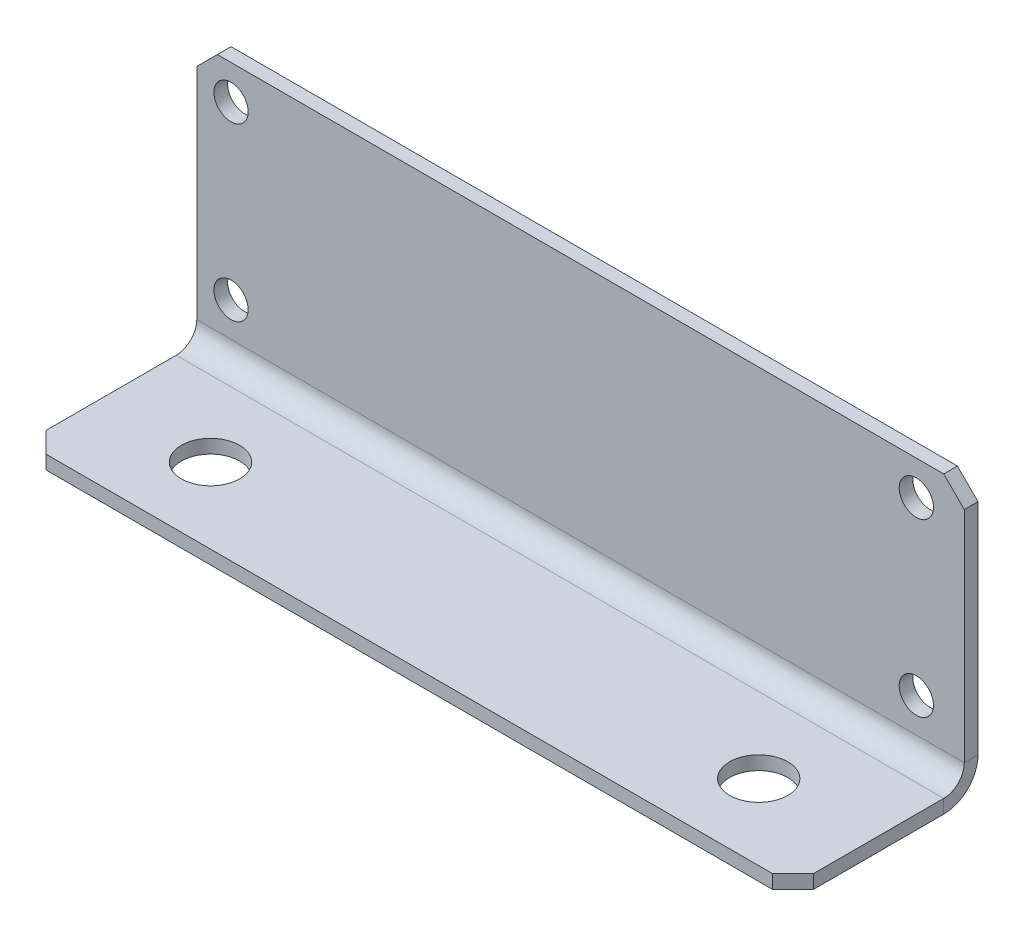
ISO-10303-21;
HEADER;
FILE_DESCRIPTION(('STEP AP214'),'2;1');
FILE_NAME('part.step','',(''),(''),'','','');
FILE_SCHEMA(('AUTOMOTIVE_DESIGN { 1 0 10303 214 1 1 1 1 }'));
ENDSEC;
DATA;
#1=APPLICATION_CONTEXT('core data for automotive mechanical design processes');
#2=APPLICATION_PROTOCOL_DEFINITION('international standard','automotive_design',2000,#1);
#3=PRODUCT_CONTEXT('',#1,'mechanical');
#4=PRODUCT('Part','Part','',(#3));
#5=PRODUCT_RELATED_PRODUCT_CATEGORY('part','',(#4));
#6=PRODUCT_DEFINITION_FORMATION('','',#4);
#7=PRODUCT_DEFINITION_CONTEXT('part definition',#1,'design');
#8=PRODUCT_DEFINITION('design','',#6,#7);
#9=PRODUCT_DEFINITION_SHAPE('','',#8);
#10=(LENGTH_UNIT() NAMED_UNIT(*) SI_UNIT(.MILLI.,.METRE.));
#11=(NAMED_UNIT(*) PLANE_ANGLE_UNIT() SI_UNIT($,.RADIAN.));
#12=(NAMED_UNIT(*) SI_UNIT($,.STERADIAN.) SOLID_ANGLE_UNIT());
#13=UNCERTAINTY_MEASURE_WITH_UNIT(LENGTH_MEASURE(1.E-05),#10,'distance_accuracy_value','');
#14=(GEOMETRIC_REPRESENTATION_CONTEXT(3) GLOBAL_UNCERTAINTY_ASSIGNED_CONTEXT((#13)) GLOBAL_UNIT_ASSIGNED_CONTEXT((#10,
#11,#12)) REPRESENTATION_CONTEXT('',''));
#15=CARTESIAN_POINT('',(0.,0.,0.));
#16=DIRECTION('',(0.,0.,1.));
#17=DIRECTION('',(1.,0.,0.));
#18=AXIS2_PLACEMENT_3D('',#15,#16,#17);
#19=CARTESIAN_POINT('',(56.,20.,2.));
#20=DIRECTION('',(-1.,0.,0.));
#21=DIRECTION('',(0.,-1.,0.));
#22=AXIS2_PLACEMENT_3D('',#19,#20,#21);
#23=PLANE('',#22);
#24=DIRECTION('',(0.,1.,0.));
#25=VECTOR('',#24,1.);
#26=CARTESIAN_POINT('',(56.,20.,0.));
#27=LINE('',#26,#25);
#28=CARTESIAN_POINT('',(56.,-15.,0.));
#29=VERTEX_POINT('',#28);
#30=CARTESIAN_POINT('',(56.,17.,0.));
#31=VERTEX_POINT('',#30);
#32=EDGE_CURVE('E215',#29,#31,#27,.T.);
#33=ORIENTED_EDGE('',*,*,#32,.T.);
#34=DIRECTION('',(0.,0.,1.));
#35=VECTOR('',#34,1.);
#36=CARTESIAN_POINT('',(56.,17.,2.));
#37=LINE('',#36,#35);
#38=CARTESIAN_POINT('',(56.,17.,2.));
#39=VERTEX_POINT('',#38);
#40=EDGE_CURVE('E77',#31,#39,#37,.T.);
#41=ORIENTED_EDGE('',*,*,#40,.T.);
#42=DIRECTION('',(0.,1.,0.));
#43=VECTOR('',#42,1.);
#44=CARTESIAN_POINT('',(56.,20.,2.));
#45=LINE('',#44,#43);
#46=CARTESIAN_POINT('',(56.,-15.,2.));
#47=VERTEX_POINT('',#46);
#48=EDGE_CURVE('E217',#47,#39,#45,.T.);
#49=ORIENTED_EDGE('',*,*,#48,.F.);
#50=DIRECTION('',(0.,0.,-1.));
#51=VECTOR('',#50,1.);
#52=CARTESIAN_POINT('',(56.,-15.,2.));
#53=LINE('',#52,#51);
#54=EDGE_CURVE('E204',#47,#29,#53,.T.);
#55=ORIENTED_EDGE('',*,*,#54,.T.);
#56=EDGE_LOOP('',(#33,#41,#49,#55));
#57=FACE_BOUND('',#56,.T.);
#58=ADVANCED_FACE('F54',(#57),#23,.F.);
#59=CARTESIAN_POINT('',(-56.,20.,2.));
#60=DIRECTION('',(1.,0.,0.));
#61=DIRECTION('',(0.,0.,-1.));
#62=AXIS2_PLACEMENT_3D('',#59,#60,#61);
#63=PLANE('',#62);
#64=DIRECTION('',(0.,-1.,0.));
#65=VECTOR('',#64,1.);
#66=CARTESIAN_POINT('',(-56.,20.,2.));
#67=LINE('',#66,#65);
#68=CARTESIAN_POINT('',(-56.,17.,2.));
#69=VERTEX_POINT('',#68);
#70=CARTESIAN_POINT('',(-56.,-15.,2.));
#71=VERTEX_POINT('',#70);
#72=EDGE_CURVE('E222',#69,#71,#67,.T.);
#73=ORIENTED_EDGE('',*,*,#72,.F.);
#74=DIRECTION('',(0.,0.,-1.));
#75=VECTOR('',#74,1.);
#76=CARTESIAN_POINT('',(-56.,17.,2.));
#77=LINE('',#76,#75);
#78=CARTESIAN_POINT('',(-56.,17.,0.));
#79=VERTEX_POINT('',#78);
#80=EDGE_CURVE('E13',#69,#79,#77,.T.);
#81=ORIENTED_EDGE('',*,*,#80,.T.);
#82=DIRECTION('',(0.,-1.,0.));
#83=VECTOR('',#82,1.);
#84=CARTESIAN_POINT('',(-56.,20.,0.));
#85=LINE('',#84,#83);
#86=CARTESIAN_POINT('',(-56.,-15.,0.));
#87=VERTEX_POINT('',#86);
#88=EDGE_CURVE('E220',#79,#87,#85,.T.);
#89=ORIENTED_EDGE('',*,*,#88,.T.);
#90=DIRECTION('',(0.,0.,-1.));
#91=VECTOR('',#90,1.);
#92=CARTESIAN_POINT('',(-56.,-15.,2.));
#93=LINE('',#92,#91);
#94=EDGE_CURVE('E212',#71,#87,#93,.T.);
#95=ORIENTED_EDGE('',*,*,#94,.F.);
#96=EDGE_LOOP('',(#73,#81,#89,#95));
#97=FACE_BOUND('',#96,.T.);
#98=ADVANCED_FACE('F295',(#97),#63,.F.);
#99=CARTESIAN_POINT('',(56.,-20.,2.));
#100=DIRECTION('',(0.,0.,1.));
#101=DIRECTION('',(1.,0.,0.));
#102=AXIS2_PLACEMENT_3D('',#99,#100,#101);
#103=PLANE('',#102);
#104=CARTESIAN_POINT('',(49.0000000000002,-10.,2.));
#105=DIRECTION('',(0.,0.,1.));
#106=DIRECTION('',(1.,0.,0.));
#107=AXIS2_PLACEMENT_3D('',#104,#105,#106);
#108=CIRCLE('',#107,2.5);
#109=CARTESIAN_POINT('',(51.5000000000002,-10.,2.));
#110=VERTEX_POINT('',#109);
#111=EDGE_CURVE('E592',#110,#110,#108,.T.);
#112=ORIENTED_EDGE('',*,*,#111,.F.);
#113=EDGE_LOOP('',(#112));
#114=FACE_BOUND('',#113,.T.);
#115=CARTESIAN_POINT('',(-50.9999999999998,-10.,2.));
#116=DIRECTION('',(0.,0.,1.));
#117=DIRECTION('',(1.,0.,0.));
#118=AXIS2_PLACEMENT_3D('',#115,#116,#117);
#119=CIRCLE('',#118,2.5);
#120=CARTESIAN_POINT('',(-48.4999999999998,-10.,2.));
#121=VERTEX_POINT('',#120);
#122=EDGE_CURVE('E588',#121,#121,#119,.T.);
#123=ORIENTED_EDGE('',*,*,#122,.F.);
#124=EDGE_LOOP('',(#123));
#125=FACE_BOUND('',#124,.T.);
#126=CARTESIAN_POINT('',(49.,15.,2.));
#127=DIRECTION('',(0.,0.,1.));
#128=DIRECTION('',(1.,0.,0.));
#129=AXIS2_PLACEMENT_3D('',#126,#127,#128);
#130=CIRCLE('',#129,2.5);
#131=CARTESIAN_POINT('',(51.5,15.,2.));
#132=VERTEX_POINT('',#131);
#133=EDGE_CURVE('E584',#132,#132,#130,.T.);
#134=ORIENTED_EDGE('',*,*,#133,.F.);
#135=EDGE_LOOP('',(#134));
#136=FACE_BOUND('',#135,.T.);
#137=CARTESIAN_POINT('',(-51.,15.,2.));
#138=DIRECTION('',(0.,0.,1.));
#139=DIRECTION('',(1.,0.,0.));
#140=AXIS2_PLACEMENT_3D('',#137,#138,#139);
#141=CIRCLE('',#140,2.5);
#142=CARTESIAN_POINT('',(-48.5,15.,2.));
#143=VERTEX_POINT('',#142);
#144=EDGE_CURVE('E562',#143,#143,#141,.T.);
#145=ORIENTED_EDGE('',*,*,#144,.F.);
#146=EDGE_LOOP('',(#145));
#147=FACE_BOUND('',#146,.T.);
#148=ORIENTED_EDGE('',*,*,#48,.T.);
#149=DIRECTION('',(0.707106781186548,-0.707106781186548,0.));
#150=VECTOR('',#149,1.);
#151=CARTESIAN_POINT('',(74.5,-1.50000000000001,2.));
#152=LINE('',#151,#150);
#153=CARTESIAN_POINT('',(52.9999999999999,20.,2.));
#154=VERTEX_POINT('',#153);
#155=EDGE_CURVE('E62',#39,#154,#152,.F.);
#156=ORIENTED_EDGE('',*,*,#155,.T.);
#157=DIRECTION('',(-1.,0.,0.));
#158=VECTOR('',#157,1.);
#159=CARTESIAN_POINT('',(-56.,20.,2.));
#160=LINE('',#159,#158);
#161=CARTESIAN_POINT('',(-53.,20.,2.));
#162=VERTEX_POINT('',#161);
#163=EDGE_CURVE('E219',#154,#162,#160,.T.);
#164=ORIENTED_EDGE('',*,*,#163,.T.);
#165=DIRECTION('',(0.707106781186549,0.707106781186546,0.));
#166=VECTOR('',#165,1.);
#167=CARTESIAN_POINT('',(-18.4999999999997,54.5000000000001,2.));
#168=LINE('',#167,#166);
#169=EDGE_CURVE('E69',#162,#69,#168,.F.);
#170=ORIENTED_EDGE('',*,*,#169,.T.);
#171=ORIENTED_EDGE('',*,*,#72,.T.);
#172=DIRECTION('',(1.,0.,0.));
#173=VECTOR('',#172,1.);
#174=CARTESIAN_POINT('',(56.,-15.,2.));
#175=LINE('',#174,#173);
#176=EDGE_CURVE('E208',#47,#71,#175,.F.);
#177=ORIENTED_EDGE('',*,*,#176,.F.);
#178=EDGE_LOOP('',(#148,#156,#164,#170,#171,#177));
#179=FACE_BOUND('',#178,.T.);
#180=ADVANCED_FACE('F258',(#114,#125,#136,#147,#179),#103,.T.);
#181=CARTESIAN_POINT('',(56.,-20.,0.));
#182=DIRECTION('',(0.,0.,1.));
#183=DIRECTION('',(1.,0.,0.));
#184=AXIS2_PLACEMENT_3D('',#181,#182,#183);
#185=PLANE('',#184);
#186=CARTESIAN_POINT('',(49.0000000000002,-10.,0.));
#187=DIRECTION('',(0.,0.,1.));
#188=DIRECTION('',(1.,0.,0.));
#189=AXIS2_PLACEMENT_3D('',#186,#187,#188);
#190=CIRCLE('',#189,2.5);
#191=CARTESIAN_POINT('',(51.5000000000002,-10.,0.));
#192=VERTEX_POINT('',#191);
#193=EDGE_CURVE('E548',#192,#192,#190,.F.);
#194=ORIENTED_EDGE('',*,*,#193,.F.);
#195=EDGE_LOOP('',(#194));
#196=FACE_BOUND('',#195,.T.);
#197=CARTESIAN_POINT('',(-50.9999999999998,-10.,0.));
#198=DIRECTION('',(0.,0.,1.));
#199=DIRECTION('',(1.,0.,0.));
#200=AXIS2_PLACEMENT_3D('',#197,#198,#199);
#201=CIRCLE('',#200,2.5);
#202=CARTESIAN_POINT('',(-48.4999999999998,-10.,0.));
#203=VERTEX_POINT('',#202);
#204=EDGE_CURVE('E552',#203,#203,#201,.F.);
#205=ORIENTED_EDGE('',*,*,#204,.F.);
#206=EDGE_LOOP('',(#205));
#207=FACE_BOUND('',#206,.T.);
#208=CARTESIAN_POINT('',(49.,15.,0.));
#209=DIRECTION('',(0.,0.,1.));
#210=DIRECTION('',(1.,0.,0.));
#211=AXIS2_PLACEMENT_3D('',#208,#209,#210);
#212=CIRCLE('',#211,2.5);
#213=CARTESIAN_POINT('',(51.5,15.,0.));
#214=VERTEX_POINT('',#213);
#215=EDGE_CURVE('E556',#214,#214,#212,.F.);
#216=ORIENTED_EDGE('',*,*,#215,.F.);
#217=EDGE_LOOP('',(#216));
#218=FACE_BOUND('',#217,.T.);
#219=CARTESIAN_POINT('',(-51.,15.,0.));
#220=DIRECTION('',(0.,0.,1.));
#221=DIRECTION('',(1.,0.,0.));
#222=AXIS2_PLACEMENT_3D('',#219,#220,#221);
#223=CIRCLE('',#222,2.5);
#224=CARTESIAN_POINT('',(-48.5,15.,0.));
#225=VERTEX_POINT('',#224);
#226=EDGE_CURVE('E559',#225,#225,#223,.F.);
#227=ORIENTED_EDGE('',*,*,#226,.F.);
#228=EDGE_LOOP('',(#227));
#229=FACE_BOUND('',#228,.T.);
#230=DIRECTION('',(-1.,0.,0.));
#231=VECTOR('',#230,1.);
#232=CARTESIAN_POINT('',(-56.,20.,0.));
#233=LINE('',#232,#231);
#234=CARTESIAN_POINT('',(53.,20.,0.));
#235=VERTEX_POINT('',#234);
#236=CARTESIAN_POINT('',(-53.,20.,0.));
#237=VERTEX_POINT('',#236);
#238=EDGE_CURVE('E226',#235,#237,#233,.T.);
#239=ORIENTED_EDGE('',*,*,#238,.F.);
#240=DIRECTION('',(-0.707106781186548,0.707106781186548,0.));
#241=VECTOR('',#240,1.);
#242=CARTESIAN_POINT('',(53.,20.,0.));
#243=LINE('',#242,#241);
#244=EDGE_CURVE('E253',#235,#31,#243,.F.);
#245=ORIENTED_EDGE('',*,*,#244,.T.);
#246=ORIENTED_EDGE('',*,*,#32,.F.);
#247=DIRECTION('',(1.,0.,0.));
#248=VECTOR('',#247,1.);
#249=CARTESIAN_POINT('',(56.,-15.,0.));
#250=LINE('',#249,#248);
#251=EDGE_CURVE('E155',#29,#87,#250,.F.);
#252=ORIENTED_EDGE('',*,*,#251,.T.);
#253=ORIENTED_EDGE('',*,*,#88,.F.);
#254=DIRECTION('',(-0.707106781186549,-0.707106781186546,0.));
#255=VECTOR('',#254,1.);
#256=CARTESIAN_POINT('',(-56.,17.,0.));
#257=LINE('',#256,#255);
#258=EDGE_CURVE('E251',#79,#237,#257,.F.);
#259=ORIENTED_EDGE('',*,*,#258,.T.);
#260=EDGE_LOOP('',(#239,#245,#246,#252,#253,#259));
#261=FACE_BOUND('',#260,.T.);
#262=ADVANCED_FACE('F268',(#196,#207,#218,#229,#261),#185,.F.);
#263=CARTESIAN_POINT('',(-56.,20.,2.));
#264=DIRECTION('',(0.,-1.,0.));
#265=DIRECTION('',(0.,0.,-1.));
#266=AXIS2_PLACEMENT_3D('',#263,#264,#265);
#267=PLANE('',#266);
#268=ORIENTED_EDGE('',*,*,#163,.F.);
#269=DIRECTION('',(0.,0.,-1.));
#270=VECTOR('',#269,1.);
#271=CARTESIAN_POINT('',(53.,20.,2.));
#272=LINE('',#271,#270);
#273=EDGE_CURVE('E248',#154,#235,#272,.T.);
#274=ORIENTED_EDGE('',*,*,#273,.T.);
#275=ORIENTED_EDGE('',*,*,#238,.T.);
#276=DIRECTION('',(0.,0.,1.));
#277=VECTOR('',#276,1.);
#278=CARTESIAN_POINT('',(-53.,20.,2.));
#279=LINE('',#278,#277);
#280=EDGE_CURVE('E246',#237,#162,#279,.T.);
#281=ORIENTED_EDGE('',*,*,#280,.T.);
#282=EDGE_LOOP('',(#268,#274,#275,#281));
#283=FACE_BOUND('',#282,.T.);
#284=ADVANCED_FACE('F262',(#283),#267,.F.);
#285=CARTESIAN_POINT('',(-56.,-15.,5.));
#286=DIRECTION('',(-1.,0.,0.));
#287=DIRECTION('',(0.,0.,1.));
#288=AXIS2_PLACEMENT_3D('',#285,#286,#287);
#289=PLANE('',#288);
#290=DIRECTION('',(0.,1.,0.));
#291=VECTOR('',#290,1.);
#292=CARTESIAN_POINT('',(-56.,-20.,4.99999999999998));
#293=LINE('',#292,#291);
#294=CARTESIAN_POINT('',(-56.,-18.,4.99999999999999));
#295=VERTEX_POINT('',#294);
#296=CARTESIAN_POINT('',(-56.,-20.,4.99999999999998));
#297=VERTEX_POINT('',#296);
#298=EDGE_CURVE('E198',#295,#297,#293,.F.);
#299=ORIENTED_EDGE('',*,*,#298,.F.);
#300=CARTESIAN_POINT('',(-56.,-15.,5.));
#301=DIRECTION('',(1.,0.,0.));
#302=DIRECTION('',(0.,0.,-1.));
#303=AXIS2_PLACEMENT_3D('',#300,#301,#302);
#304=CIRCLE('',#303,3.);
#305=EDGE_CURVE('E158',#71,#295,#304,.F.);
#306=ORIENTED_EDGE('',*,*,#305,.F.);
#307=ORIENTED_EDGE('',*,*,#94,.T.);
#308=CARTESIAN_POINT('',(-56.,-15.,5.));
#309=DIRECTION('',(1.,0.,0.));
#310=DIRECTION('',(0.,0.,-1.));
#311=AXIS2_PLACEMENT_3D('',#308,#309,#310);
#312=CIRCLE('',#311,5.);
#313=EDGE_CURVE('E203',#87,#297,#312,.F.);
#314=ORIENTED_EDGE('',*,*,#313,.T.);
#315=EDGE_LOOP('',(#299,#306,#307,#314));
#316=FACE_BOUND('',#315,.T.);
#317=ADVANCED_FACE('F292',(#316),#289,.T.);
#318=CARTESIAN_POINT('',(56.,-15.,5.));
#319=DIRECTION('',(-1.,0.,0.));
#320=DIRECTION('',(0.,0.,1.));
#321=AXIS2_PLACEMENT_3D('',#318,#319,#320);
#322=PLANE('',#321);
#323=CARTESIAN_POINT('',(56.,-15.,5.));
#324=DIRECTION('',(1.,0.,0.));
#325=DIRECTION('',(0.,0.,-1.));
#326=AXIS2_PLACEMENT_3D('',#323,#324,#325);
#327=CIRCLE('',#326,3.);
#328=CARTESIAN_POINT('',(56.,-18.,4.99999999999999));
#329=VERTEX_POINT('',#328);
#330=EDGE_CURVE('E165',#329,#47,#327,.T.);
#331=ORIENTED_EDGE('',*,*,#330,.F.);
#332=DIRECTION('',(0.,1.,0.));
#333=VECTOR('',#332,1.);
#334=CARTESIAN_POINT('',(56.,-18.,4.99999999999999));
#335=LINE('',#334,#333);
#336=CARTESIAN_POINT('',(56.,-20.,4.99999999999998));
#337=VERTEX_POINT('',#336);
#338=EDGE_CURVE('E162',#329,#337,#335,.F.);
#339=ORIENTED_EDGE('',*,*,#338,.T.);
#340=CARTESIAN_POINT('',(56.,-15.,5.));
#341=DIRECTION('',(1.,0.,0.));
#342=DIRECTION('',(0.,0.,-1.));
#343=AXIS2_PLACEMENT_3D('',#340,#341,#342);
#344=CIRCLE('',#343,5.);
#345=EDGE_CURVE('E147',#337,#29,#344,.T.);
#346=ORIENTED_EDGE('',*,*,#345,.T.);
#347=ORIENTED_EDGE('',*,*,#54,.F.);
#348=EDGE_LOOP('',(#331,#339,#346,#347));
#349=FACE_BOUND('',#348,.T.);
#350=ADVANCED_FACE('F163',(#349),#322,.F.);
#351=CARTESIAN_POINT('',(56.,-15.,5.));
#352=DIRECTION('',(1.,0.,0.));
#353=DIRECTION('',(0.,-1.,0.));
#354=AXIS2_PLACEMENT_3D('',#351,#352,#353);
#355=CYLINDRICAL_SURFACE('',#354,5.);
#356=ORIENTED_EDGE('',*,*,#251,.F.);
#357=ORIENTED_EDGE('',*,*,#345,.F.);
#358=DIRECTION('',(1.,0.,0.));
#359=VECTOR('',#358,1.);
#360=CARTESIAN_POINT('',(-56.,-20.,4.99999999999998));
#361=LINE('',#360,#359);
#362=EDGE_CURVE('E152',#337,#297,#361,.F.);
#363=ORIENTED_EDGE('',*,*,#362,.T.);
#364=ORIENTED_EDGE('',*,*,#313,.F.);
#365=EDGE_LOOP('',(#356,#357,#363,#364));
#366=FACE_BOUND('',#365,.T.);
#367=ADVANCED_FACE('F149',(#366),#355,.T.);
#368=CARTESIAN_POINT('',(56.,-15.,5.));
#369=DIRECTION('',(1.,0.,0.));
#370=DIRECTION('',(0.,-1.,0.));
#371=AXIS2_PLACEMENT_3D('',#368,#369,#370);
#372=CYLINDRICAL_SURFACE('',#371,3.);
#373=ORIENTED_EDGE('',*,*,#176,.T.);
#374=ORIENTED_EDGE('',*,*,#305,.T.);
#375=DIRECTION('',(1.,0.,0.));
#376=VECTOR('',#375,1.);
#377=CARTESIAN_POINT('',(-56.,-18.,4.99999999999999));
#378=LINE('',#377,#376);
#379=EDGE_CURVE('E170',#295,#329,#378,.T.);
#380=ORIENTED_EDGE('',*,*,#379,.T.);
#381=ORIENTED_EDGE('',*,*,#330,.T.);
#382=EDGE_LOOP('',(#373,#374,#380,#381));
#383=FACE_BOUND('',#382,.T.);
#384=ADVANCED_FACE('F270',(#383),#372,.F.);
#385=CARTESIAN_POINT('',(-56.,-20.,1.99999999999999));
#386=DIRECTION('',(1.,0.,0.));
#387=DIRECTION('',(0.,0.,-1.));
#388=AXIS2_PLACEMENT_3D('',#385,#386,#387);
#389=PLANE('',#388);
#390=DIRECTION('',(0.,0.,-1.));
#391=VECTOR('',#390,1.);
#392=CARTESIAN_POINT('',(-56.,-20.0000000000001,27.));
#393=LINE('',#392,#391);
#394=CARTESIAN_POINT('',(-56.,-20.0000000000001,24.));
#395=VERTEX_POINT('',#394);
#396=EDGE_CURVE('E179',#395,#297,#393,.T.);
#397=ORIENTED_EDGE('',*,*,#396,.F.);
#398=DIRECTION('',(0.,1.,0.));
#399=VECTOR('',#398,1.);
#400=CARTESIAN_POINT('',(-56.,-20.0000000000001,24.));
#401=LINE('',#400,#399);
#402=CARTESIAN_POINT('',(-56.,-18.0000000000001,24.));
#403=VERTEX_POINT('',#402);
#404=EDGE_CURVE('E224',#395,#403,#401,.T.);
#405=ORIENTED_EDGE('',*,*,#404,.T.);
#406=DIRECTION('',(0.,0.,1.));
#407=VECTOR('',#406,1.);
#408=CARTESIAN_POINT('',(-56.,-18.,2.));
#409=LINE('',#408,#407);
#410=EDGE_CURVE('E180',#403,#295,#409,.F.);
#411=ORIENTED_EDGE('',*,*,#410,.T.);
#412=ORIENTED_EDGE('',*,*,#298,.T.);
#413=EDGE_LOOP('',(#397,#405,#411,#412));
#414=FACE_BOUND('',#413,.T.);
#415=ADVANCED_FACE('F289',(#414),#389,.F.);
#416=CARTESIAN_POINT('',(56.,-20.0000000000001,27.));
#417=DIRECTION('',(-1.,0.,0.));
#418=DIRECTION('',(0.,0.,1.));
#419=AXIS2_PLACEMENT_3D('',#416,#417,#418);
#420=PLANE('',#419);
#421=DIRECTION('',(0.,0.,-1.));
#422=VECTOR('',#421,1.);
#423=CARTESIAN_POINT('',(56.,-18.0000000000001,27.));
#424=LINE('',#423,#422);
#425=CARTESIAN_POINT('',(56.,-18.0000000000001,24.));
#426=VERTEX_POINT('',#425);
#427=EDGE_CURVE('E194',#329,#426,#424,.F.);
#428=ORIENTED_EDGE('',*,*,#427,.T.);
#429=DIRECTION('',(0.,-1.,0.));
#430=VECTOR('',#429,1.);
#431=CARTESIAN_POINT('',(56.,-20.0000000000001,24.));
#432=LINE('',#431,#430);
#433=CARTESIAN_POINT('',(56.,-20.0000000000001,24.));
#434=VERTEX_POINT('',#433);
#435=EDGE_CURVE('E184',#426,#434,#432,.T.);
#436=ORIENTED_EDGE('',*,*,#435,.T.);
#437=DIRECTION('',(0.,0.,1.));
#438=VECTOR('',#437,1.);
#439=CARTESIAN_POINT('',(56.,-20.0000000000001,27.));
#440=LINE('',#439,#438);
#441=EDGE_CURVE('E176',#337,#434,#440,.T.);
#442=ORIENTED_EDGE('',*,*,#441,.F.);
#443=ORIENTED_EDGE('',*,*,#338,.F.);
#444=EDGE_LOOP('',(#428,#436,#442,#443));
#445=FACE_BOUND('',#444,.T.);
#446=ADVANCED_FACE('F182',(#445),#420,.F.);
#447=CARTESIAN_POINT('',(-56.,-20.0000000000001,27.));
#448=DIRECTION('',(0.,1.,0.));
#449=DIRECTION('',(0.,0.,1.));
#450=AXIS2_PLACEMENT_3D('',#447,#448,#449);
#451=PLANE('',#450);
#452=CARTESIAN_POINT('',(40.,-20.,16.));
#453=DIRECTION('',(0.,1.,0.));
#454=DIRECTION('',(0.,0.,1.));
#455=AXIS2_PLACEMENT_3D('',#452,#453,#454);
#456=CIRCLE('',#455,4.25);
#457=CARTESIAN_POINT('',(40.,-20.0000000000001,20.25));
#458=VERTEX_POINT('',#457);
#459=EDGE_CURVE('E565',#458,#458,#456,.F.);
#460=ORIENTED_EDGE('',*,*,#459,.F.);
#461=EDGE_LOOP('',(#460));
#462=FACE_BOUND('',#461,.T.);
#463=CARTESIAN_POINT('',(-40.,-20.,16.));
#464=DIRECTION('',(0.,1.,0.));
#465=DIRECTION('',(0.,0.,1.));
#466=AXIS2_PLACEMENT_3D('',#463,#464,#465);
#467=CIRCLE('',#466,4.25);
#468=CARTESIAN_POINT('',(-40.,-20.0000000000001,20.25));
#469=VERTEX_POINT('',#468);
#470=EDGE_CURVE('E201',#469,#469,#467,.F.);
#471=ORIENTED_EDGE('',*,*,#470,.F.);
#472=EDGE_LOOP('',(#471));
#473=FACE_BOUND('',#472,.T.);
#474=DIRECTION('',(-1.,0.,0.));
#475=VECTOR('',#474,1.);
#476=CARTESIAN_POINT('',(-56.,-20.0000000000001,27.));
#477=LINE('',#476,#475);
#478=CARTESIAN_POINT('',(53.,-20.0000000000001,27.));
#479=VERTEX_POINT('',#478);
#480=CARTESIAN_POINT('',(-53.,-20.0000000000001,27.));
#481=VERTEX_POINT('',#480);
#482=EDGE_CURVE('E185',#479,#481,#477,.T.);
#483=ORIENTED_EDGE('',*,*,#482,.T.);
#484=DIRECTION('',(0.707106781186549,0.,0.707106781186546));
#485=VECTOR('',#484,1.);
#486=CARTESIAN_POINT('',(-56.,-20.0000000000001,24.));
#487=LINE('',#486,#485);
#488=EDGE_CURVE('E243',#481,#395,#487,.F.);
#489=ORIENTED_EDGE('',*,*,#488,.T.);
#490=ORIENTED_EDGE('',*,*,#396,.T.);
#491=ORIENTED_EDGE('',*,*,#362,.F.);
#492=ORIENTED_EDGE('',*,*,#441,.T.);
#493=DIRECTION('',(0.707106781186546,0.,-0.707106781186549));
#494=VECTOR('',#493,1.);
#495=CARTESIAN_POINT('',(53.,-20.0000000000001,27.));
#496=LINE('',#495,#494);
#497=EDGE_CURVE('E241',#434,#479,#496,.F.);
#498=ORIENTED_EDGE('',*,*,#497,.T.);
#499=EDGE_LOOP('',(#483,#489,#490,#491,#492,#498));
#500=FACE_BOUND('',#499,.T.);
#501=ADVANCED_FACE('F175',(#462,#473,#500),#451,.F.);
#502=CARTESIAN_POINT('',(-56.,-18.0000000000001,27.));
#503=DIRECTION('',(0.,1.,0.));
#504=DIRECTION('',(0.,0.,1.));
#505=AXIS2_PLACEMENT_3D('',#502,#503,#504);
#506=PLANE('',#505);
#507=CARTESIAN_POINT('',(40.,-18.,16.));
#508=DIRECTION('',(0.,1.,0.));
#509=DIRECTION('',(0.,0.,1.));
#510=AXIS2_PLACEMENT_3D('',#507,#508,#509);
#511=CIRCLE('',#510,4.25);
#512=CARTESIAN_POINT('',(40.,-18.0000000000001,20.25));
#513=VERTEX_POINT('',#512);
#514=EDGE_CURVE('E561',#513,#513,#511,.T.);
#515=ORIENTED_EDGE('',*,*,#514,.F.);
#516=EDGE_LOOP('',(#515));
#517=FACE_BOUND('',#516,.T.);
#518=CARTESIAN_POINT('',(-40.,-18.,16.));
#519=DIRECTION('',(0.,1.,0.));
#520=DIRECTION('',(0.,0.,1.));
#521=AXIS2_PLACEMENT_3D('',#518,#519,#520);
#522=CIRCLE('',#521,4.25);
#523=CARTESIAN_POINT('',(-40.,-18.0000000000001,20.25));
#524=VERTEX_POINT('',#523);
#525=EDGE_CURVE('E573',#524,#524,#522,.T.);
#526=ORIENTED_EDGE('',*,*,#525,.F.);
#527=EDGE_LOOP('',(#526));
#528=FACE_BOUND('',#527,.T.);
#529=ORIENTED_EDGE('',*,*,#410,.F.);
#530=DIRECTION('',(-0.707106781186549,0.,-0.707106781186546));
#531=VECTOR('',#530,1.);
#532=CARTESIAN_POINT('',(-54.5,-18.0000000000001,25.5));
#533=LINE('',#532,#531);
#534=CARTESIAN_POINT('',(-53.,-18.0000000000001,27.));
#535=VERTEX_POINT('',#534);
#536=EDGE_CURVE('E234',#403,#535,#533,.F.);
#537=ORIENTED_EDGE('',*,*,#536,.T.);
#538=DIRECTION('',(1.,0.,0.));
#539=VECTOR('',#538,1.);
#540=CARTESIAN_POINT('',(-56.,-18.0000000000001,27.));
#541=LINE('',#540,#539);
#542=CARTESIAN_POINT('',(53.,-18.0000000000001,27.));
#543=VERTEX_POINT('',#542);
#544=EDGE_CURVE('E188',#543,#535,#541,.F.);
#545=ORIENTED_EDGE('',*,*,#544,.F.);
#546=DIRECTION('',(-0.707106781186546,0.,0.707106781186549));
#547=VECTOR('',#546,1.);
#548=CARTESIAN_POINT('',(-1.49999999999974,-18.0000000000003,81.5));
#549=LINE('',#548,#547);
#550=EDGE_CURVE('E232',#543,#426,#549,.F.);
#551=ORIENTED_EDGE('',*,*,#550,.T.);
#552=ORIENTED_EDGE('',*,*,#427,.F.);
#553=ORIENTED_EDGE('',*,*,#379,.F.);
#554=EDGE_LOOP('',(#529,#537,#545,#551,#552,#553));
#555=FACE_BOUND('',#554,.T.);
#556=ADVANCED_FACE('F275',(#517,#528,#555),#506,.T.);
#557=CARTESIAN_POINT('',(-56.,-20.0000000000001,27.));
#558=DIRECTION('',(0.,0.,-1.));
#559=DIRECTION('',(0.,1.,0.));
#560=AXIS2_PLACEMENT_3D('',#557,#558,#559);
#561=PLANE('',#560);
#562=ORIENTED_EDGE('',*,*,#544,.T.);
#563=DIRECTION('',(0.,-1.,0.));
#564=VECTOR('',#563,1.);
#565=CARTESIAN_POINT('',(-53.,-20.0000000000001,27.));
#566=LINE('',#565,#564);
#567=EDGE_CURVE('E239',#535,#481,#566,.T.);
#568=ORIENTED_EDGE('',*,*,#567,.T.);
#569=ORIENTED_EDGE('',*,*,#482,.F.);
#570=DIRECTION('',(0.,1.,0.));
#571=VECTOR('',#570,1.);
#572=CARTESIAN_POINT('',(53.,-20.0000000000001,27.));
#573=LINE('',#572,#571);
#574=EDGE_CURVE('E236',#479,#543,#573,.T.);
#575=ORIENTED_EDGE('',*,*,#574,.T.);
#576=EDGE_LOOP('',(#562,#568,#569,#575));
#577=FACE_BOUND('',#576,.T.);
#578=ADVANCED_FACE('F283',(#577),#561,.F.);
#579=CARTESIAN_POINT('',(-40.,-20.0010000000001,16.));
#580=DIRECTION('',(0.,1.,0.));
#581=DIRECTION('',(0.,0.,1.));
#582=AXIS2_PLACEMENT_3D('',#579,#580,#581);
#583=CYLINDRICAL_SURFACE('',#582,4.25);
#584=ORIENTED_EDGE('',*,*,#525,.T.);
#585=EDGE_LOOP('',(#584));
#586=FACE_BOUND('',#585,.T.);
#587=ORIENTED_EDGE('',*,*,#470,.T.);
#588=EDGE_LOOP('',(#587));
#589=FACE_BOUND('',#588,.T.);
#590=ADVANCED_FACE('F389',(#586,#589),#583,.F.);
#591=CARTESIAN_POINT('',(40.,-20.0010000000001,16.));
#592=DIRECTION('',(0.,1.,0.));
#593=DIRECTION('',(0.,0.,1.));
#594=AXIS2_PLACEMENT_3D('',#591,#592,#593);
#595=CYLINDRICAL_SURFACE('',#594,4.25);
#596=ORIENTED_EDGE('',*,*,#514,.T.);
#597=EDGE_LOOP('',(#596));
#598=FACE_BOUND('',#597,.T.);
#599=ORIENTED_EDGE('',*,*,#459,.T.);
#600=EDGE_LOOP('',(#599));
#601=FACE_BOUND('',#600,.T.);
#602=ADVANCED_FACE('F378',(#598,#601),#595,.F.);
#603=CARTESIAN_POINT('',(-51.,15.,-0.00100000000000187));
#604=DIRECTION('',(0.,0.,1.));
#605=DIRECTION('',(1.,0.,0.));
#606=AXIS2_PLACEMENT_3D('',#603,#604,#605);
#607=CYLINDRICAL_SURFACE('',#606,2.5);
#608=ORIENTED_EDGE('',*,*,#144,.T.);
#609=EDGE_LOOP('',(#608));
#610=FACE_BOUND('',#609,.T.);
#611=ORIENTED_EDGE('',*,*,#226,.T.);
#612=EDGE_LOOP('',(#611));
#613=FACE_BOUND('',#612,.T.);
#614=ADVANCED_FACE('F367',(#610,#613),#607,.F.);
#615=CARTESIAN_POINT('',(49.,15.,-0.00100000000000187));
#616=DIRECTION('',(0.,0.,1.));
#617=DIRECTION('',(1.,0.,0.));
#618=AXIS2_PLACEMENT_3D('',#615,#616,#617);
#619=CYLINDRICAL_SURFACE('',#618,2.5);
#620=ORIENTED_EDGE('',*,*,#133,.T.);
#621=EDGE_LOOP('',(#620));
#622=FACE_BOUND('',#621,.T.);
#623=ORIENTED_EDGE('',*,*,#215,.T.);
#624=EDGE_LOOP('',(#623));
#625=FACE_BOUND('',#624,.T.);
#626=ADVANCED_FACE('F356',(#622,#625),#619,.F.);
#627=CARTESIAN_POINT('',(-50.9999999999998,-10.,-0.00100000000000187));
#628=DIRECTION('',(0.,0.,1.));
#629=DIRECTION('',(1.,0.,0.));
#630=AXIS2_PLACEMENT_3D('',#627,#628,#629);
#631=CYLINDRICAL_SURFACE('',#630,2.5);
#632=ORIENTED_EDGE('',*,*,#122,.T.);
#633=EDGE_LOOP('',(#632));
#634=FACE_BOUND('',#633,.T.);
#635=ORIENTED_EDGE('',*,*,#204,.T.);
#636=EDGE_LOOP('',(#635));
#637=FACE_BOUND('',#636,.T.);
#638=ADVANCED_FACE('F345',(#634,#637),#631,.F.);
#639=CARTESIAN_POINT('',(49.0000000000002,-10.,-0.00100000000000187));
#640=DIRECTION('',(0.,0.,1.));
#641=DIRECTION('',(1.,0.,0.));
#642=AXIS2_PLACEMENT_3D('',#639,#640,#641);
#643=CYLINDRICAL_SURFACE('',#642,2.5);
#644=ORIENTED_EDGE('',*,*,#111,.T.);
#645=EDGE_LOOP('',(#644));
#646=FACE_BOUND('',#645,.T.);
#647=ORIENTED_EDGE('',*,*,#193,.T.);
#648=EDGE_LOOP('',(#647));
#649=FACE_BOUND('',#648,.T.);
#650=ADVANCED_FACE('F313',(#646,#649),#643,.F.);
#651=CARTESIAN_POINT('',(-56.,-20.0000000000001,24.));
#652=DIRECTION('',(0.707106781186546,0.,-0.707106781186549));
#653=DIRECTION('',(-0.707106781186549,0.,-0.707106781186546));
#654=AXIS2_PLACEMENT_3D('',#651,#652,#653);
#655=PLANE('',#654);
#656=ORIENTED_EDGE('',*,*,#488,.F.);
#657=ORIENTED_EDGE('',*,*,#567,.F.);
#658=ORIENTED_EDGE('',*,*,#536,.F.);
#659=ORIENTED_EDGE('',*,*,#404,.F.);
#660=EDGE_LOOP('',(#656,#657,#658,#659));
#661=FACE_BOUND('',#660,.T.);
#662=ADVANCED_FACE('F286',(#661),#655,.F.);
#663=CARTESIAN_POINT('',(53.,-20.0000000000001,27.));
#664=DIRECTION('',(-0.707106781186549,0.,-0.707106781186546));
#665=DIRECTION('',(-0.707106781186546,0.,0.707106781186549));
#666=AXIS2_PLACEMENT_3D('',#663,#664,#665);
#667=PLANE('',#666);
#668=ORIENTED_EDGE('',*,*,#497,.F.);
#669=ORIENTED_EDGE('',*,*,#435,.F.);
#670=ORIENTED_EDGE('',*,*,#550,.F.);
#671=ORIENTED_EDGE('',*,*,#574,.F.);
#672=EDGE_LOOP('',(#668,#669,#670,#671));
#673=FACE_BOUND('',#672,.T.);
#674=ADVANCED_FACE('F278',(#673),#667,.F.);
#675=CARTESIAN_POINT('',(53.,20.,2.));
#676=DIRECTION('',(-0.707106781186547,-0.707106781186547,0.));
#677=DIRECTION('',(0.707106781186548,-0.707106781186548,0.));
#678=AXIS2_PLACEMENT_3D('',#675,#676,#677);
#679=PLANE('',#678);
#680=ORIENTED_EDGE('',*,*,#155,.F.);
#681=ORIENTED_EDGE('',*,*,#40,.F.);
#682=ORIENTED_EDGE('',*,*,#244,.F.);
#683=ORIENTED_EDGE('',*,*,#273,.F.);
#684=EDGE_LOOP('',(#680,#681,#682,#683));
#685=FACE_BOUND('',#684,.T.);
#686=ADVANCED_FACE('F265',(#685),#679,.F.);
#687=CARTESIAN_POINT('',(-56.,17.,2.));
#688=DIRECTION('',(0.707106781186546,-0.707106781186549,0.));
#689=DIRECTION('',(0.707106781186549,0.707106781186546,0.));
#690=AXIS2_PLACEMENT_3D('',#687,#688,#689);
#691=PLANE('',#690);
#692=ORIENTED_EDGE('',*,*,#169,.F.);
#693=ORIENTED_EDGE('',*,*,#280,.F.);
#694=ORIENTED_EDGE('',*,*,#258,.F.);
#695=ORIENTED_EDGE('',*,*,#80,.F.);
#696=EDGE_LOOP('',(#692,#693,#694,#695));
#697=FACE_BOUND('',#696,.T.);
#698=ADVANCED_FACE('F56',(#697),#691,.F.);
#699=CLOSED_SHELL('',(#58,#98,#180,#262,#284,#317,#350,#367,#384,#415,#446,#501,#556,#578,#590,
#602,#614,#626,#638,#650,#662,#674,#686,#698));
#700=MANIFOLD_SOLID_BREP('B2',#699);
#701=ADVANCED_BREP_SHAPE_REPRESENTATION('',(#18,#700),#14);
#702=SHAPE_DEFINITION_REPRESENTATION(#9,#701);
ENDSEC;
END-ISO-10303-21;
